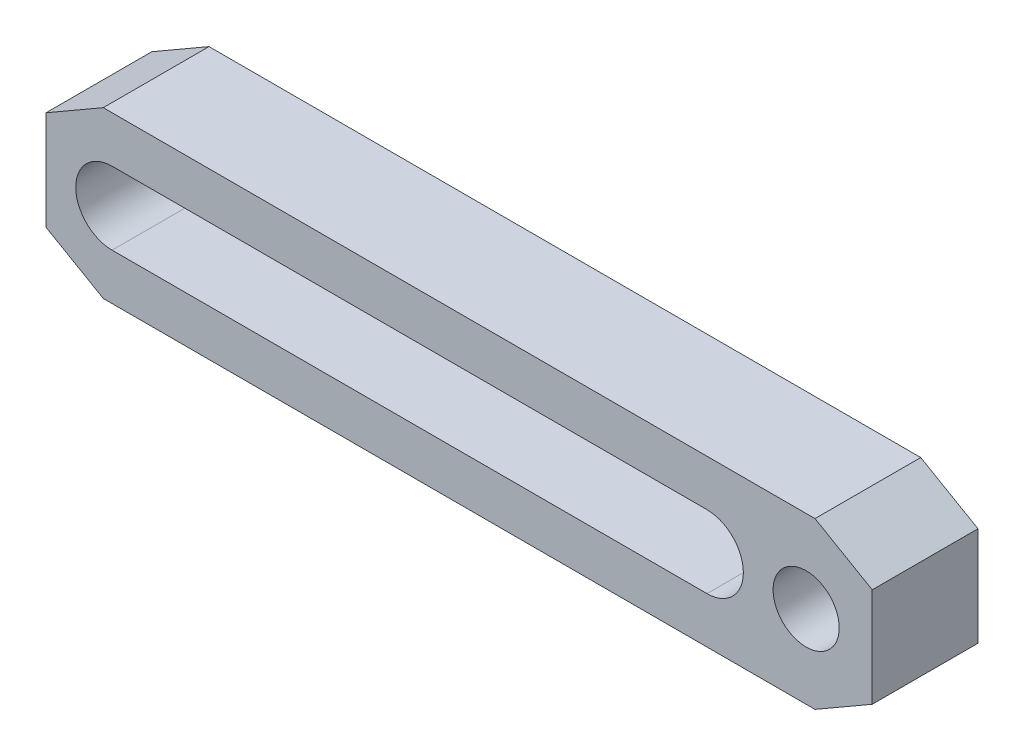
ISO-10303-21;
HEADER;
FILE_DESCRIPTION(('STEP AP214'),'2;1');
FILE_NAME('part.step','',(''),(''),'','','');
FILE_SCHEMA(('AUTOMOTIVE_DESIGN { 1 0 10303 214 1 1 1 1 }'));
ENDSEC;
DATA;
#1=APPLICATION_CONTEXT('core data for automotive mechanical design processes');
#2=APPLICATION_PROTOCOL_DEFINITION('international standard','automotive_design',2000,#1);
#3=PRODUCT_CONTEXT('',#1,'mechanical');
#4=PRODUCT('Part','Part','',(#3));
#5=PRODUCT_RELATED_PRODUCT_CATEGORY('part','',(#4));
#6=PRODUCT_DEFINITION_FORMATION('','',#4);
#7=PRODUCT_DEFINITION_CONTEXT('part definition',#1,'design');
#8=PRODUCT_DEFINITION('design','',#6,#7);
#9=PRODUCT_DEFINITION_SHAPE('','',#8);
#10=(LENGTH_UNIT() NAMED_UNIT(*) SI_UNIT(.MILLI.,.METRE.));
#11=(NAMED_UNIT(*) PLANE_ANGLE_UNIT() SI_UNIT($,.RADIAN.));
#12=(NAMED_UNIT(*) SI_UNIT($,.STERADIAN.) SOLID_ANGLE_UNIT());
#13=UNCERTAINTY_MEASURE_WITH_UNIT(LENGTH_MEASURE(1.E-05),#10,'distance_accuracy_value','');
#14=(GEOMETRIC_REPRESENTATION_CONTEXT(3) GLOBAL_UNCERTAINTY_ASSIGNED_CONTEXT((#13)) GLOBAL_UNIT_ASSIGNED_CONTEXT((#10,
#11,#12)) REPRESENTATION_CONTEXT('',''));
#15=CARTESIAN_POINT('',(0.,0.,0.));
#16=DIRECTION('',(0.,0.,1.));
#17=DIRECTION('',(1.,0.,0.));
#18=AXIS2_PLACEMENT_3D('',#15,#16,#17);
#19=CARTESIAN_POINT('',(1.,5.5,16.));
#20=DIRECTION('',(0.,-1.,0.));
#21=DIRECTION('',(1.,0.,0.));
#22=AXIS2_PLACEMENT_3D('',#19,#20,#21);
#23=PLANE('',#22);
#24=DIRECTION('',(-1.,0.,0.));
#25=VECTOR('',#24,1.);
#26=CARTESIAN_POINT('',(1.,5.5,0.));
#27=LINE('',#26,#25);
#28=CARTESIAN_POINT('',(0.,5.5,0.));
#29=VERTEX_POINT('',#28);
#30=CARTESIAN_POINT('',(-90.,5.5,0.));
#31=VERTEX_POINT('',#30);
#32=EDGE_CURVE('E104',#29,#31,#27,.T.);
#33=ORIENTED_EDGE('',*,*,#32,.F.);
#34=DIRECTION('',(0.,0.,1.));
#35=VECTOR('',#34,1.);
#36=CARTESIAN_POINT('',(0.,5.5,0.));
#37=LINE('',#36,#35);
#38=CARTESIAN_POINT('',(0.,5.5,16.));
#39=VERTEX_POINT('',#38);
#40=EDGE_CURVE('E106',#29,#39,#37,.T.);
#41=ORIENTED_EDGE('',*,*,#40,.T.);
#42=DIRECTION('',(-1.,0.,0.));
#43=VECTOR('',#42,1.);
#44=CARTESIAN_POINT('',(1.,5.5,16.));
#45=LINE('',#44,#43);
#46=CARTESIAN_POINT('',(-90.,5.5,16.));
#47=VERTEX_POINT('',#46);
#48=EDGE_CURVE('E141',#39,#47,#45,.T.);
#49=ORIENTED_EDGE('',*,*,#48,.T.);
#50=DIRECTION('',(0.,0.,-1.));
#51=VECTOR('',#50,1.);
#52=CARTESIAN_POINT('',(-90.,5.5,16.));
#53=LINE('',#52,#51);
#54=EDGE_CURVE('E109',#47,#31,#53,.T.);
#55=ORIENTED_EDGE('',*,*,#54,.T.);
#56=EDGE_LOOP('',(#33,#41,#49,#55));
#57=FACE_BOUND('',#56,.T.);
#58=ADVANCED_FACE('F14',(#57),#23,.T.);
#59=CARTESIAN_POINT('',(1.,-5.5,16.));
#60=DIRECTION('',(0.,1.,0.));
#61=DIRECTION('',(-1.,0.,0.));
#62=AXIS2_PLACEMENT_3D('',#59,#60,#61);
#63=PLANE('',#62);
#64=DIRECTION('',(1.,0.,0.));
#65=VECTOR('',#64,1.);
#66=CARTESIAN_POINT('',(1.,-5.5,16.));
#67=LINE('',#66,#65);
#68=CARTESIAN_POINT('',(-90.,-5.5,16.));
#69=VERTEX_POINT('',#68);
#70=CARTESIAN_POINT('',(0.,-5.5,16.));
#71=VERTEX_POINT('',#70);
#72=EDGE_CURVE('E145',#69,#71,#67,.T.);
#73=ORIENTED_EDGE('',*,*,#72,.T.);
#74=DIRECTION('',(0.,0.,1.));
#75=VECTOR('',#74,1.);
#76=CARTESIAN_POINT('',(0.,-5.5,0.));
#77=LINE('',#76,#75);
#78=CARTESIAN_POINT('',(0.,-5.5,0.));
#79=VERTEX_POINT('',#78);
#80=EDGE_CURVE('E124',#79,#71,#77,.T.);
#81=ORIENTED_EDGE('',*,*,#80,.F.);
#82=DIRECTION('',(1.,0.,0.));
#83=VECTOR('',#82,1.);
#84=CARTESIAN_POINT('',(1.,-5.5,0.));
#85=LINE('',#84,#83);
#86=CARTESIAN_POINT('',(-90.,-5.5,0.));
#87=VERTEX_POINT('',#86);
#88=EDGE_CURVE('E128',#87,#79,#85,.T.);
#89=ORIENTED_EDGE('',*,*,#88,.F.);
#90=DIRECTION('',(0.,0.,-1.));
#91=VECTOR('',#90,1.);
#92=CARTESIAN_POINT('',(-90.,-5.5,16.));
#93=LINE('',#92,#91);
#94=EDGE_CURVE('E29',#69,#87,#93,.T.);
#95=ORIENTED_EDGE('',*,*,#94,.F.);
#96=EDGE_LOOP('',(#73,#81,#89,#95));
#97=FACE_BOUND('',#96,.T.);
#98=ADVANCED_FACE('F245',(#97),#63,.T.);
#99=CARTESIAN_POINT('',(-37.5,43.5843918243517,16.));
#100=DIRECTION('',(0.,0.,1.));
#101=DIRECTION('',(0.,1.,0.));
#102=AXIS2_PLACEMENT_3D('',#99,#100,#101);
#103=PLANE('',#102);
#104=CARTESIAN_POINT('',(0.,0.,16.));
#105=DIRECTION('',(0.,0.,1.));
#106=DIRECTION('',(1.,0.,0.));
#107=AXIS2_PLACEMENT_3D('',#104,#105,#106);
#108=CIRCLE('',#107,5.5);
#109=EDGE_CURVE('E123',#71,#39,#108,.T.);
#110=ORIENTED_EDGE('',*,*,#109,.F.);
#111=ORIENTED_EDGE('',*,*,#72,.F.);
#112=CARTESIAN_POINT('',(-90.,0.,16.));
#113=DIRECTION('',(0.,0.,1.));
#114=DIRECTION('',(0.,1.,0.));
#115=AXIS2_PLACEMENT_3D('',#112,#113,#114);
#116=CIRCLE('',#115,5.5);
#117=EDGE_CURVE('E143',#47,#69,#116,.T.);
#118=ORIENTED_EDGE('',*,*,#117,.F.);
#119=ORIENTED_EDGE('',*,*,#48,.F.);
#120=EDGE_LOOP('',(#110,#111,#118,#119));
#121=FACE_BOUND('',#120,.T.);
#122=CARTESIAN_POINT('',(15.,0.,16.));
#123=DIRECTION('',(0.,0.,1.));
#124=DIRECTION('',(1.,0.,0.));
#125=AXIS2_PLACEMENT_3D('',#122,#123,#124);
#126=CIRCLE('',#125,5.);
#127=CARTESIAN_POINT('',(20.,0.,16.));
#128=VERTEX_POINT('',#127);
#129=EDGE_CURVE('E133',#128,#128,#126,.T.);
#130=ORIENTED_EDGE('',*,*,#129,.F.);
#131=EDGE_LOOP('',(#130));
#132=FACE_BOUND('',#131,.T.);
#133=DIRECTION('',(-0.866025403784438,-0.5,0.));
#134=VECTOR('',#133,1.);
#135=CARTESIAN_POINT('',(-100.,7.5,16.));
#136=LINE('',#135,#134);
#137=CARTESIAN_POINT('',(-91.3397459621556,12.5,16.));
#138=VERTEX_POINT('',#137);
#139=CARTESIAN_POINT('',(-100.,7.5,16.));
#140=VERTEX_POINT('',#139);
#141=EDGE_CURVE('E166',#138,#140,#136,.T.);
#142=ORIENTED_EDGE('',*,*,#141,.T.);
#143=DIRECTION('',(0.,-1.,0.));
#144=VECTOR('',#143,1.);
#145=CARTESIAN_POINT('',(-100.,-7.5,16.));
#146=LINE('',#145,#144);
#147=CARTESIAN_POINT('',(-100.,-7.5,16.));
#148=VERTEX_POINT('',#147);
#149=EDGE_CURVE('E168',#140,#148,#146,.T.);
#150=ORIENTED_EDGE('',*,*,#149,.T.);
#151=DIRECTION('',(0.866025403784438,-0.5,0.));
#152=VECTOR('',#151,1.);
#153=CARTESIAN_POINT('',(-100.,-7.5,16.));
#154=LINE('',#153,#152);
#155=CARTESIAN_POINT('',(-91.3397459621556,-12.5,16.));
#156=VERTEX_POINT('',#155);
#157=EDGE_CURVE('E170',#148,#156,#154,.T.);
#158=ORIENTED_EDGE('',*,*,#157,.T.);
#159=DIRECTION('',(1.,0.,0.));
#160=VECTOR('',#159,1.);
#161=CARTESIAN_POINT('',(16.3397459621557,-12.5,16.));
#162=LINE('',#161,#160);
#163=CARTESIAN_POINT('',(16.3397459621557,-12.5,16.));
#164=VERTEX_POINT('',#163);
#165=EDGE_CURVE('E172',#156,#164,#162,.T.);
#166=ORIENTED_EDGE('',*,*,#165,.T.);
#167=DIRECTION('',(0.866025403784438,0.5,0.));
#168=VECTOR('',#167,1.);
#169=CARTESIAN_POINT('',(25.,-7.5,16.));
#170=LINE('',#169,#168);
#171=CARTESIAN_POINT('',(25.,-7.5,16.));
#172=VERTEX_POINT('',#171);
#173=EDGE_CURVE('E174',#164,#172,#170,.T.);
#174=ORIENTED_EDGE('',*,*,#173,.T.);
#175=DIRECTION('',(0.,1.,0.));
#176=VECTOR('',#175,1.);
#177=CARTESIAN_POINT('',(25.,-7.5,16.));
#178=LINE('',#177,#176);
#179=CARTESIAN_POINT('',(25.,7.5,16.));
#180=VERTEX_POINT('',#179);
#181=EDGE_CURVE('E176',#172,#180,#178,.T.);
#182=ORIENTED_EDGE('',*,*,#181,.T.);
#183=DIRECTION('',(-0.866025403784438,0.5,0.));
#184=VECTOR('',#183,1.);
#185=CARTESIAN_POINT('',(25.,7.5,16.));
#186=LINE('',#185,#184);
#187=CARTESIAN_POINT('',(16.3397459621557,12.5,16.));
#188=VERTEX_POINT('',#187);
#189=EDGE_CURVE('E178',#180,#188,#186,.T.);
#190=ORIENTED_EDGE('',*,*,#189,.T.);
#191=DIRECTION('',(-1.,0.,0.));
#192=VECTOR('',#191,1.);
#193=CARTESIAN_POINT('',(16.3397459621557,12.5,16.));
#194=LINE('',#193,#192);
#195=EDGE_CURVE('E37',#188,#138,#194,.T.);
#196=ORIENTED_EDGE('',*,*,#195,.T.);
#197=EDGE_LOOP('',(#142,#150,#158,#166,#174,#182,#190,#196));
#198=FACE_BOUND('',#197,.T.);
#199=ADVANCED_FACE('F219',(#121,#132,#198),#103,.T.);
#200=CARTESIAN_POINT('',(-37.5,43.5843918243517,0.));
#201=DIRECTION('',(0.,0.,1.));
#202=DIRECTION('',(0.,1.,0.));
#203=AXIS2_PLACEMENT_3D('',#200,#201,#202);
#204=PLANE('',#203);
#205=CARTESIAN_POINT('',(15.,0.,0.));
#206=DIRECTION('',(0.,0.,1.));
#207=DIRECTION('',(1.,0.,0.));
#208=AXIS2_PLACEMENT_3D('',#205,#206,#207);
#209=CIRCLE('',#208,5.);
#210=CARTESIAN_POINT('',(20.,0.,0.));
#211=VERTEX_POINT('',#210);
#212=EDGE_CURVE('E115',#211,#211,#209,.T.);
#213=ORIENTED_EDGE('',*,*,#212,.T.);
#214=EDGE_LOOP('',(#213));
#215=FACE_BOUND('',#214,.T.);
#216=ORIENTED_EDGE('',*,*,#88,.T.);
#217=CARTESIAN_POINT('',(0.,0.,0.));
#218=DIRECTION('',(0.,0.,1.));
#219=DIRECTION('',(1.,0.,0.));
#220=AXIS2_PLACEMENT_3D('',#217,#218,#219);
#221=CIRCLE('',#220,5.5);
#222=EDGE_CURVE('E121',#79,#29,#221,.T.);
#223=ORIENTED_EDGE('',*,*,#222,.T.);
#224=ORIENTED_EDGE('',*,*,#32,.T.);
#225=CARTESIAN_POINT('',(-90.,0.,0.));
#226=DIRECTION('',(0.,0.,1.));
#227=DIRECTION('',(0.,1.,0.));
#228=AXIS2_PLACEMENT_3D('',#225,#226,#227);
#229=CIRCLE('',#228,5.5);
#230=EDGE_CURVE('E114',#31,#87,#229,.T.);
#231=ORIENTED_EDGE('',*,*,#230,.T.);
#232=EDGE_LOOP('',(#216,#223,#224,#231));
#233=FACE_BOUND('',#232,.T.);
#234=DIRECTION('',(-0.866025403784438,-0.5,0.));
#235=VECTOR('',#234,1.);
#236=CARTESIAN_POINT('',(-100.,7.5,0.));
#237=LINE('',#236,#235);
#238=CARTESIAN_POINT('',(-91.3397459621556,12.5,0.));
#239=VERTEX_POINT('',#238);
#240=CARTESIAN_POINT('',(-100.,7.5,0.));
#241=VERTEX_POINT('',#240);
#242=EDGE_CURVE('E149',#239,#241,#237,.T.);
#243=ORIENTED_EDGE('',*,*,#242,.F.);
#244=DIRECTION('',(-1.,0.,0.));
#245=VECTOR('',#244,1.);
#246=CARTESIAN_POINT('',(16.3397459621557,12.5,0.));
#247=LINE('',#246,#245);
#248=CARTESIAN_POINT('',(16.3397459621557,12.5,0.));
#249=VERTEX_POINT('',#248);
#250=EDGE_CURVE('E164',#249,#239,#247,.T.);
#251=ORIENTED_EDGE('',*,*,#250,.F.);
#252=DIRECTION('',(-0.866025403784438,0.5,0.));
#253=VECTOR('',#252,1.);
#254=CARTESIAN_POINT('',(25.,7.5,0.));
#255=LINE('',#254,#253);
#256=CARTESIAN_POINT('',(25.,7.5,0.));
#257=VERTEX_POINT('',#256);
#258=EDGE_CURVE('E162',#257,#249,#255,.T.);
#259=ORIENTED_EDGE('',*,*,#258,.F.);
#260=DIRECTION('',(0.,1.,0.));
#261=VECTOR('',#260,1.);
#262=CARTESIAN_POINT('',(25.,-7.5,0.));
#263=LINE('',#262,#261);
#264=CARTESIAN_POINT('',(25.,-7.5,0.));
#265=VERTEX_POINT('',#264);
#266=EDGE_CURVE('E160',#265,#257,#263,.T.);
#267=ORIENTED_EDGE('',*,*,#266,.F.);
#268=DIRECTION('',(0.866025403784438,0.5,0.));
#269=VECTOR('',#268,1.);
#270=CARTESIAN_POINT('',(25.,-7.5,0.));
#271=LINE('',#270,#269);
#272=CARTESIAN_POINT('',(16.3397459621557,-12.5,0.));
#273=VERTEX_POINT('',#272);
#274=EDGE_CURVE('E158',#273,#265,#271,.T.);
#275=ORIENTED_EDGE('',*,*,#274,.F.);
#276=DIRECTION('',(1.,0.,0.));
#277=VECTOR('',#276,1.);
#278=CARTESIAN_POINT('',(16.3397459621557,-12.5,0.));
#279=LINE('',#278,#277);
#280=CARTESIAN_POINT('',(-91.3397459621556,-12.5,0.));
#281=VERTEX_POINT('',#280);
#282=EDGE_CURVE('E156',#281,#273,#279,.T.);
#283=ORIENTED_EDGE('',*,*,#282,.F.);
#284=DIRECTION('',(0.866025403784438,-0.5,0.));
#285=VECTOR('',#284,1.);
#286=CARTESIAN_POINT('',(-100.,-7.5,0.));
#287=LINE('',#286,#285);
#288=CARTESIAN_POINT('',(-100.,-7.5,0.));
#289=VERTEX_POINT('',#288);
#290=EDGE_CURVE('E154',#289,#281,#287,.T.);
#291=ORIENTED_EDGE('',*,*,#290,.F.);
#292=DIRECTION('',(0.,-1.,0.));
#293=VECTOR('',#292,1.);
#294=CARTESIAN_POINT('',(-100.,-7.5,0.));
#295=LINE('',#294,#293);
#296=EDGE_CURVE('E152',#241,#289,#295,.T.);
#297=ORIENTED_EDGE('',*,*,#296,.F.);
#298=EDGE_LOOP('',(#243,#251,#259,#267,#275,#283,#291,#297));
#299=FACE_BOUND('',#298,.T.);
#300=ADVANCED_FACE('F126',(#215,#233,#299),#204,.F.);
#301=CARTESIAN_POINT('',(-100.,7.5,16.));
#302=DIRECTION('',(0.5,-0.866025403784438,0.));
#303=DIRECTION('',(0.866025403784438,0.5,0.));
#304=AXIS2_PLACEMENT_3D('',#301,#302,#303);
#305=PLANE('',#304);
#306=ORIENTED_EDGE('',*,*,#242,.T.);
#307=DIRECTION('',(0.,0.,-1.));
#308=VECTOR('',#307,1.);
#309=CARTESIAN_POINT('',(-100.,7.5,16.));
#310=LINE('',#309,#308);
#311=EDGE_CURVE('E9',#140,#241,#310,.T.);
#312=ORIENTED_EDGE('',*,*,#311,.F.);
#313=ORIENTED_EDGE('',*,*,#141,.F.);
#314=DIRECTION('',(0.,0.,-1.));
#315=VECTOR('',#314,1.);
#316=CARTESIAN_POINT('',(-91.3397459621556,12.5,16.));
#317=LINE('',#316,#315);
#318=EDGE_CURVE('E181',#138,#239,#317,.T.);
#319=ORIENTED_EDGE('',*,*,#318,.T.);
#320=EDGE_LOOP('',(#306,#312,#313,#319));
#321=FACE_BOUND('',#320,.T.);
#322=ADVANCED_FACE('F16',(#321),#305,.F.);
#323=CARTESIAN_POINT('',(-100.,-7.5,16.));
#324=DIRECTION('',(1.,0.,0.));
#325=DIRECTION('',(0.,1.,0.));
#326=AXIS2_PLACEMENT_3D('',#323,#324,#325);
#327=PLANE('',#326);
#328=ORIENTED_EDGE('',*,*,#296,.T.);
#329=DIRECTION('',(0.,0.,-1.));
#330=VECTOR('',#329,1.);
#331=CARTESIAN_POINT('',(-100.,-7.5,16.));
#332=LINE('',#331,#330);
#333=EDGE_CURVE('E22',#148,#289,#332,.T.);
#334=ORIENTED_EDGE('',*,*,#333,.F.);
#335=ORIENTED_EDGE('',*,*,#149,.F.);
#336=ORIENTED_EDGE('',*,*,#311,.T.);
#337=EDGE_LOOP('',(#328,#334,#335,#336));
#338=FACE_BOUND('',#337,.T.);
#339=ADVANCED_FACE('F223',(#338),#327,.F.);
#340=CARTESIAN_POINT('',(-100.,-7.5,16.));
#341=DIRECTION('',(0.5,0.866025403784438,0.));
#342=DIRECTION('',(-0.866025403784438,0.5,0.));
#343=AXIS2_PLACEMENT_3D('',#340,#341,#342);
#344=PLANE('',#343);
#345=ORIENTED_EDGE('',*,*,#290,.T.);
#346=DIRECTION('',(0.,0.,-1.));
#347=VECTOR('',#346,1.);
#348=CARTESIAN_POINT('',(-91.3397459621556,-12.5,16.));
#349=LINE('',#348,#347);
#350=EDGE_CURVE('E196',#156,#281,#349,.T.);
#351=ORIENTED_EDGE('',*,*,#350,.F.);
#352=ORIENTED_EDGE('',*,*,#157,.F.);
#353=ORIENTED_EDGE('',*,*,#333,.T.);
#354=EDGE_LOOP('',(#345,#351,#352,#353));
#355=FACE_BOUND('',#354,.T.);
#356=ADVANCED_FACE('F203',(#355),#344,.F.);
#357=CARTESIAN_POINT('',(16.3397459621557,-12.5,16.));
#358=DIRECTION('',(0.,1.,0.));
#359=DIRECTION('',(-1.,0.,0.));
#360=AXIS2_PLACEMENT_3D('',#357,#358,#359);
#361=PLANE('',#360);
#362=ORIENTED_EDGE('',*,*,#282,.T.);
#363=DIRECTION('',(0.,0.,-1.));
#364=VECTOR('',#363,1.);
#365=CARTESIAN_POINT('',(16.3397459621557,-12.5,16.));
#366=LINE('',#365,#364);
#367=EDGE_CURVE('E193',#164,#273,#366,.T.);
#368=ORIENTED_EDGE('',*,*,#367,.F.);
#369=ORIENTED_EDGE('',*,*,#165,.F.);
#370=ORIENTED_EDGE('',*,*,#350,.T.);
#371=EDGE_LOOP('',(#362,#368,#369,#370));
#372=FACE_BOUND('',#371,.T.);
#373=ADVANCED_FACE('F212',(#372),#361,.F.);
#374=CARTESIAN_POINT('',(25.,-7.5,16.));
#375=DIRECTION('',(-0.5,0.866025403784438,0.));
#376=DIRECTION('',(-0.866025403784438,-0.5,0.));
#377=AXIS2_PLACEMENT_3D('',#374,#375,#376);
#378=PLANE('',#377);
#379=ORIENTED_EDGE('',*,*,#274,.T.);
#380=DIRECTION('',(0.,0.,-1.));
#381=VECTOR('',#380,1.);
#382=CARTESIAN_POINT('',(25.,-7.5,16.));
#383=LINE('',#382,#381);
#384=EDGE_CURVE('E190',#172,#265,#383,.T.);
#385=ORIENTED_EDGE('',*,*,#384,.F.);
#386=ORIENTED_EDGE('',*,*,#173,.F.);
#387=ORIENTED_EDGE('',*,*,#367,.T.);
#388=EDGE_LOOP('',(#379,#385,#386,#387));
#389=FACE_BOUND('',#388,.T.);
#390=ADVANCED_FACE('F216',(#389),#378,.F.);
#391=CARTESIAN_POINT('',(25.,-7.5,16.));
#392=DIRECTION('',(-1.,0.,0.));
#393=DIRECTION('',(0.,-1.,0.));
#394=AXIS2_PLACEMENT_3D('',#391,#392,#393);
#395=PLANE('',#394);
#396=ORIENTED_EDGE('',*,*,#266,.T.);
#397=DIRECTION('',(0.,0.,-1.));
#398=VECTOR('',#397,1.);
#399=CARTESIAN_POINT('',(25.,7.5,16.));
#400=LINE('',#399,#398);
#401=EDGE_CURVE('E187',#180,#257,#400,.T.);
#402=ORIENTED_EDGE('',*,*,#401,.F.);
#403=ORIENTED_EDGE('',*,*,#181,.F.);
#404=ORIENTED_EDGE('',*,*,#384,.T.);
#405=EDGE_LOOP('',(#396,#402,#403,#404));
#406=FACE_BOUND('',#405,.T.);
#407=ADVANCED_FACE('F234',(#406),#395,.F.);
#408=CARTESIAN_POINT('',(25.,7.5,16.));
#409=DIRECTION('',(-0.5,-0.866025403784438,0.));
#410=DIRECTION('',(0.866025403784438,-0.5,0.));
#411=AXIS2_PLACEMENT_3D('',#408,#409,#410);
#412=PLANE('',#411);
#413=ORIENTED_EDGE('',*,*,#258,.T.);
#414=DIRECTION('',(0.,0.,-1.));
#415=VECTOR('',#414,1.);
#416=CARTESIAN_POINT('',(16.3397459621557,12.5,16.));
#417=LINE('',#416,#415);
#418=EDGE_CURVE('E184',#188,#249,#417,.T.);
#419=ORIENTED_EDGE('',*,*,#418,.F.);
#420=ORIENTED_EDGE('',*,*,#189,.F.);
#421=ORIENTED_EDGE('',*,*,#401,.T.);
#422=EDGE_LOOP('',(#413,#419,#420,#421));
#423=FACE_BOUND('',#422,.T.);
#424=ADVANCED_FACE('F232',(#423),#412,.F.);
#425=CARTESIAN_POINT('',(16.3397459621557,12.5,16.));
#426=DIRECTION('',(0.,-1.,0.));
#427=DIRECTION('',(1.,0.,0.));
#428=AXIS2_PLACEMENT_3D('',#425,#426,#427);
#429=PLANE('',#428);
#430=ORIENTED_EDGE('',*,*,#250,.T.);
#431=ORIENTED_EDGE('',*,*,#318,.F.);
#432=ORIENTED_EDGE('',*,*,#195,.F.);
#433=ORIENTED_EDGE('',*,*,#418,.T.);
#434=EDGE_LOOP('',(#430,#431,#432,#433));
#435=FACE_BOUND('',#434,.T.);
#436=ADVANCED_FACE('F228',(#435),#429,.F.);
#437=CARTESIAN_POINT('',(-90.,0.,16.));
#438=DIRECTION('',(0.,0.,-1.));
#439=DIRECTION('',(0.,-1.,0.));
#440=AXIS2_PLACEMENT_3D('',#437,#438,#439);
#441=CYLINDRICAL_SURFACE('',#440,5.5);
#442=ORIENTED_EDGE('',*,*,#230,.F.);
#443=ORIENTED_EDGE('',*,*,#54,.F.);
#444=ORIENTED_EDGE('',*,*,#117,.T.);
#445=ORIENTED_EDGE('',*,*,#94,.T.);
#446=EDGE_LOOP('',(#442,#443,#444,#445));
#447=FACE_BOUND('',#446,.T.);
#448=ADVANCED_FACE('F253',(#447),#441,.F.);
#449=CARTESIAN_POINT('',(15.,0.,0.));
#450=DIRECTION('',(0.,0.,1.));
#451=DIRECTION('',(1.,0.,0.));
#452=AXIS2_PLACEMENT_3D('',#449,#450,#451);
#453=CYLINDRICAL_SURFACE('',#452,5.);
#454=ORIENTED_EDGE('',*,*,#212,.F.);
#455=EDGE_LOOP('',(#454));
#456=FACE_BOUND('',#455,.T.);
#457=ORIENTED_EDGE('',*,*,#129,.T.);
#458=EDGE_LOOP('',(#457));
#459=FACE_BOUND('',#458,.T.);
#460=ADVANCED_FACE('F264',(#456,#459),#453,.F.);
#461=CARTESIAN_POINT('',(0.,0.,0.));
#462=DIRECTION('',(0.,0.,1.));
#463=DIRECTION('',(1.,0.,0.));
#464=AXIS2_PLACEMENT_3D('',#461,#462,#463);
#465=CYLINDRICAL_SURFACE('',#464,5.5);
#466=ORIENTED_EDGE('',*,*,#109,.T.);
#467=ORIENTED_EDGE('',*,*,#40,.F.);
#468=ORIENTED_EDGE('',*,*,#222,.F.);
#469=ORIENTED_EDGE('',*,*,#80,.T.);
#470=EDGE_LOOP('',(#466,#467,#468,#469));
#471=FACE_BOUND('',#470,.T.);
#472=ADVANCED_FACE('F119',(#471),#465,.F.);
#473=CLOSED_SHELL('',(#58,#98,#199,#300,#322,#339,#356,#373,#390,#407,#424,#436,#448,#460,#472));
#474=MANIFOLD_SOLID_BREP('B1',#473);
#475=ADVANCED_BREP_SHAPE_REPRESENTATION('',(#18,#474),#14);
#476=SHAPE_DEFINITION_REPRESENTATION(#9,#475);
ENDSEC;
END-ISO-10303-21;
